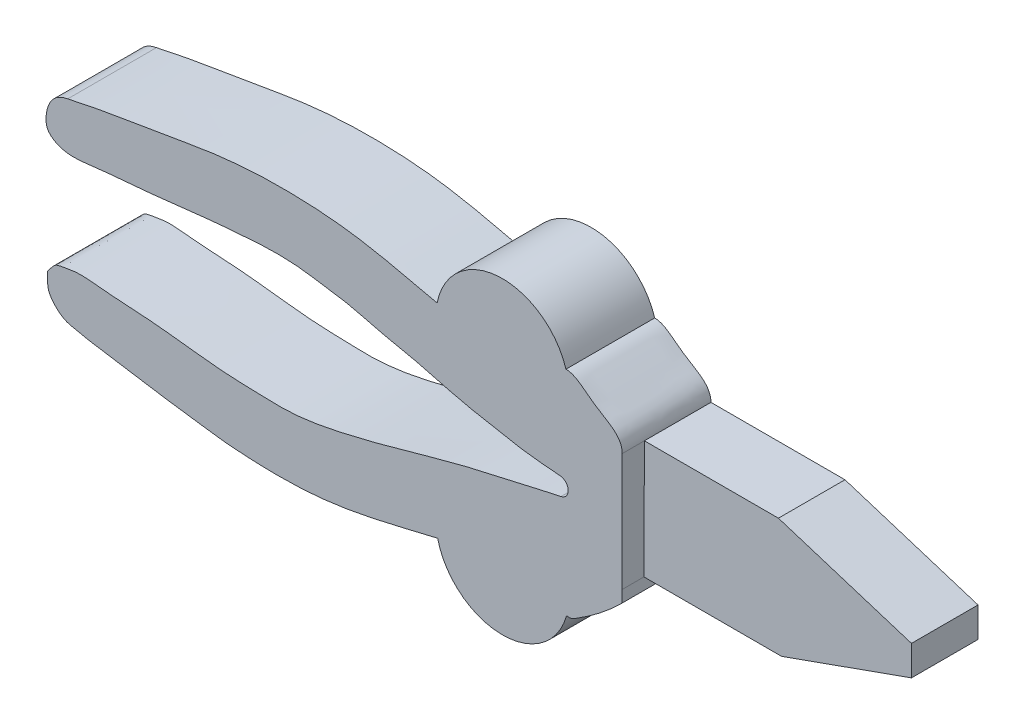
from build123d import *

# Parameters (mm, degrees)
BOSS_EXTRU_2_DEPTH      = 10
BOSS_EXTRU_2_DEPTH_BACK = 10
ENL_V_MAT_EXTRU_1_DEPTH = 5
BOSS_EXTRU_3_DEPTH      = 20


with BuildPart() as part:
    # Esquisse1 → Boss.-Extru.2 (new, two sides: drawn at the far end of the back side and taken through both)
    with BuildSketch(Plane.XY.offset(-BOSS_EXTRU_2_DEPTH_BACK)):
        with BuildLine():
            Line((148.195345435, 48.615228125), (178.406074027, 48.615228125))
            Line((178.406074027, 48.615228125), (208.388071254, 39.167839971))
            Line((208.388071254, 39.167839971), (208.388071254, 32.423343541))
            Line((208.388071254, 32.423343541), (179.092730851, 21.994731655))
            Line((179.092730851, 21.994731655), (148.092389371, 21.994731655))
            Line((148.092389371, 21.994731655), (148.092389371, 19.343108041))
            add(Edge.make_bspline(
                [(134.407607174, 33.344788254), (131.644718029, 32.808783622), (126.500486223, 31.479365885), (118.049906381, 29.713950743), (108.971990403, 27.549850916), (97.439413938, 24.154873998), (87.03638992, 21.444350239), (77.699048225, 19.603215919), (71.753550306, 19.094383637), (66.026547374, 19.384361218), (59.767510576, 19.446958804), (51.558255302, 20.31475719), (41.233228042, 21.580266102), (32.323485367, 21.893005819), (25.762472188, 22.70361196), (22.744853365, 22.0764125), (20.348508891, 21.726229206), (19.478412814, 20.432009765), (18.563663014, 19.541164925), (18.713047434, 18.431949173), (18.626551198, 17.294888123), (18.826230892, 15.601326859), (20.27242802, 13.478356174), (22.325247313, 11.804927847), (25.019643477, 11.218236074), (27.58314514, 10.649458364), (30.94727006, 10.165005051), (34.908038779, 9.561817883), (39.353305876, 8.797342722), (44.527205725, 7.961263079), (50.972704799, 7.170136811), (57.751754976, 6.059514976), (65.933594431, 5.561943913), (74.140878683, 5.418580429), (85.888428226, 6.419469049), (97.963010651, 9.216043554), (109.313963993, 11.934845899), (116.49227451, 13.774062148), (121.116113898, 14.830979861), (125.162180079, 15.018246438), (128.579084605, 13.929485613), (131.857000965, 12.649999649), (134.03138576, 11.075258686), (136.535797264, 10.417671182), (138.245004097, 11.533701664), (142.241840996, 14.136844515), (145.655062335, 16.876318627), (148.092389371, 19.343108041)],
                knots=[0.039975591, 0.039975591, 0.039975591, 0.039975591, 0.071307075, 0.099225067, 0.136194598, 0.175306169, 0.233233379, 0.255959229, 0.281356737, 0.299480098, 0.319845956, 0.351100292, 0.391447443, 0.43559517, 0.45102518, 0.46405051, 0.470512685, 0.476394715, 0.480932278, 0.483628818, 0.488248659, 0.493852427, 0.502141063, 0.516248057, 0.521993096, 0.532673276, 0.54558212, 0.559835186, 0.577350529, 0.595860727, 0.6182539, 0.649744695, 0.672360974, 0.709566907, 0.741168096, 0.803525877, 0.847391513, 0.871365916, 0.886107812, 0.900290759, 0.915819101, 0.925679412, 0.939304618, 0.945950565, 0.952609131, 0.960791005, 1, 1, 1, 1], degree=3))
            ThreePointArc((134.407607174, 33.344788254), (136.020420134, 35.466622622), (134.092722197, 37.307091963))
            add(Edge.make_bspline(
                [(134.092722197, 37.307091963), (133.063047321, 37.341098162), (124.630728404, 38.213901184), (124.157133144, 38.55094302), (112.075012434, 40.477178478), (102.482234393, 43.431566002), (93.49757998, 45.037068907), (86.677924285, 47.005276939), (81.095493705, 47.729052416), (72.080548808, 49.209492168), (64.929042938, 48.601445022), (59.506261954, 48.151246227)],
                knots=[0.127697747, 0.127697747, 0.127697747, 0.127697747, 0.163270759, 0.247839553, 0.374229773, 0.51091056, 0.616621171, 0.684612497, 0.756306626, 0.810586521, 1, 1, 1, 1], degree=3))
            add(Edge.make_bspline(
                [(59.506261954, 48.151246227), (53.613865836, 47.674676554), (45.494568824, 46.506609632), (35.100582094, 45.686672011), (29.344666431, 45.118683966), (24.56892829, 44.47568511), (21.049274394, 44.973365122), (18.255015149, 47.03368573), (18.261756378, 51.787583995), (20.041548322, 54.792448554), (23.207606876, 55.368687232)],
                knots=[0, 0, 0, 0, 0.340161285, 0.471866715, 0.5998778, 0.673452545, 0.74821084, 0.801311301, 0.854834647, 1, 1, 1, 1], degree=3))
            add(Edge.make_bspline(
                [(23.207606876, 55.368687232), (30.386421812, 57.013237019), (41.371395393, 58.546607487), (55.786731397, 61.256031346), (65.902113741, 62.134731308), (76.000358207, 62.182992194), (86.881902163, 61.428721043), (98.404876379, 59.084091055), (108.007941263, 56.732330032), (114.889680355, 55.493518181), (119.259709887, 54.447436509), (123.71087219, 54.00911899), (127.447413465, 55.049055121), (131.066184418, 56.320138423), (133.229967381, 57.668449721), (135.229107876, 58.931321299), (137.365129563, 58.483078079), (139.70090978, 56.862611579), (143.61387382, 53.670143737), (148.208099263, 51.821880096), (148.195345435, 48.615228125)],
                knots=[0, 0, 0, 0, 0.168059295, 0.253278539, 0.334896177, 0.399544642, 0.483864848, 0.583511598, 0.66765355, 0.709759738, 0.743097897, 0.770429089, 0.810760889, 0.830317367, 0.857661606, 0.86973735, 0.882054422, 0.904377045, 0.934265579, 1, 1, 1, 1], degree=3))
        make_face()
    extrude(amount=BOSS_EXTRU_2_DEPTH + BOSS_EXTRU_2_DEPTH_BACK)

    # Esquisse3 → Enl_v. mat.-Extru.1 (cut)
    with BuildSketch(Plane.XY.offset(10)):
        Polygon((148.092389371, 21.994731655), (179.092730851, 21.994731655), (208.388071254, 32.423343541), (208.388071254, 39.167839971), (178.406074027, 48.615228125), (148.195345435, 48.615228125), align=None)
    extrude(amount=-ENL_V_MAT_EXTRU_1_DEPTH, mode=Mode.SUBTRACT)

    # Esquisse4 → Boss.-Extru.3 (add)
    with BuildSketch(Plane(origin=(0, 0, -10), x_dir=(-1, 0, 0), z_dir=(0, 0, -1))):
        with BuildLine():
            Line((-133.843021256, 46.221378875), (-106.896390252, 49.7537928))
            ThreePointArc((-106.896390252, 49.7537928), (-123.145003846, 69.158642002), (-133.843021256, 46.221378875))
        make_face()
        with BuildLine():
            Line((-134.501576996, 21.648292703), (-106.896390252, 19.256212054))
            ThreePointArc((-106.896390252, 19.256212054), (-122.490292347, -0.219881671), (-134.501576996, 21.648292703))
        make_face()
    extrude(amount=-BOSS_EXTRU_3_DEPTH)


solid = part.part
